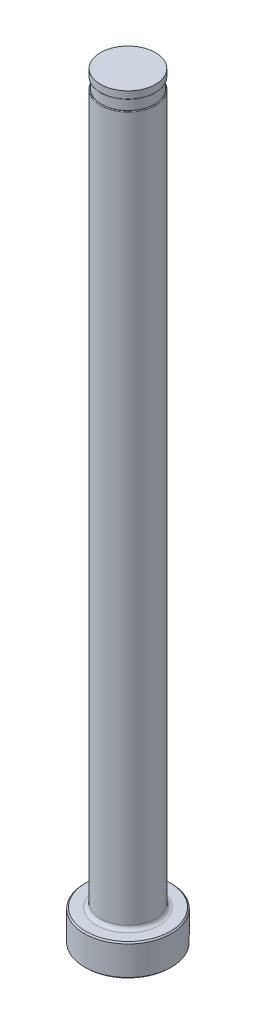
from build123d import *

# Parameters (mm, degrees)
CHAMFER1_SIZE     = 0.254
FILLET1_R         = 0.762
SKETCH2_W         = 0.2032
SKETCH2_H         = 2.032
D_SLOT_DEPTH      = 153.898684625
D_SLOT_DEPTH_BACK = 153.898684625
SKETCH5_W         = 0.0254
SKETCH5_H         = 1.524
FILLET2_R         = 0.127


with BuildPart() as part:
    # Sketch1 → Revolve1 (revolve)
    with BuildSketch(Plane.XY, mode=Mode.PRIVATE) as revolve1_sk:
        Polygon((0, 0), (-8.7249, 0), (-8.7249, 6.35), (-5.55625, 6.35), (-5.55625, 152.4), (0, 152.4), align=None)
    revolve(revolve1_sk.sketch.rotate(Axis((0, 259.958771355, 0), (0, -1, 0)), 270), axis=Axis((0, 259.958771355, 0), (0, -1, 0)))

    # Chamfer1
    chamfer1_edges = [part.edges().sort_by_distance(p)[0] for p in [
        (0, 6.35, -8.7249),
        (0, 0, -8.7249),
    ]]
    chamfer(chamfer1_edges, length=CHAMFER1_SIZE)

    # Fillet1
    fillet1_edges = [part.edges().sort_by_distance(p)[0] for p in [
        (0, 6.35, -5.55625),
    ]]
    fillet(fillet1_edges, radius=FILLET1_R)

    # Sketch2 → Vent Relief (revolve, cut)
    with BuildSketch(Plane.XY, mode=Mode.PRIVATE) as vent_relief_sk:
        with Locations((-5.45465, 149.86)):
            Rectangle(SKETCH2_W, SKETCH2_H)
    revolve(vent_relief_sk.sketch.rotate(Axis((0, 153.448281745, 0), (0, -1, 0)), 270), axis=Axis((0, 153.448281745, 0), (0, -1, 0)), mode=Mode.SUBTRACT)

    # Sketch3 → D-Slot (cut, two sides: drawn at the far end of the back side and taken through both)
    with BuildSketch(Plane.XY.offset(-D_SLOT_DEPTH_BACK)):
        with BuildLine():
            Line((-5.35305, 149.86), (-5.35305, 86.36))
            ThreePointArc((-5.35305, 86.36), (-5.404263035, 85.792038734), (-5.55625, 85.2424))
            Line((-5.55625, 85.2424), (-5.55625, 149.86))
            Line((-5.55625, 149.86), (-5.35305, 149.86))
        make_face()
    extrude(amount=D_SLOT_DEPTH + D_SLOT_DEPTH_BACK, mode=Mode.SUBTRACT)

    # Sketch5 → Vent Diameter (revolve, cut)
    with BuildSketch(Plane.XY, mode=Mode.PRIVATE) as vent_diameter_sk:
        with Locations((-5.54355, 151.638)):
            Rectangle(SKETCH5_W, SKETCH5_H)
    revolve(vent_diameter_sk.sketch.rotate(Axis((0, 152.687735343, 0), (0, -1, 0)), 90), axis=Axis((0, 152.687735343, 0), (0, -1, 0)), mode=Mode.SUBTRACT)

    # Fillet2
    fillet2_edges = [part.edges().sort_by_distance(p)[0] for p in [
        (4.424054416, 148.844, -3.361496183),
        (0, 150.876, 5.53085),
    ]]
    fillet(fillet2_edges, radius=FILLET2_R)


solid = part.part
